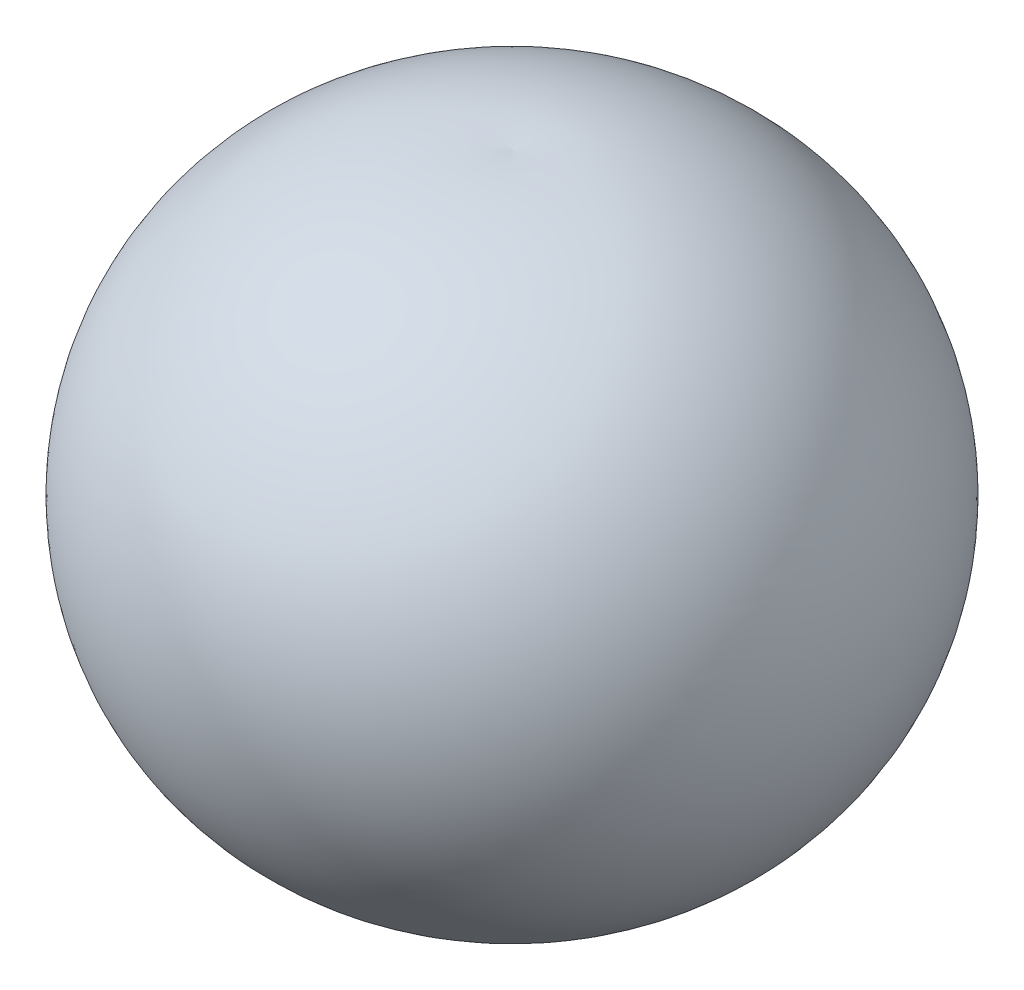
from build123d import *


with BuildPart() as part:
    # Sketch1 → Revolve1 (revolve)
    with BuildSketch(Plane.XY):
        with BuildLine():
            Line((0, 7.888436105), (0, -7.888436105))
            ThreePointArc((0, -7.888436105), (8.683107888, 0), (0, 7.888436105))
        make_face()
    revolve(axis=Axis((0, 45.680376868, 0), (0, -1, 0)))


solid = part.part
